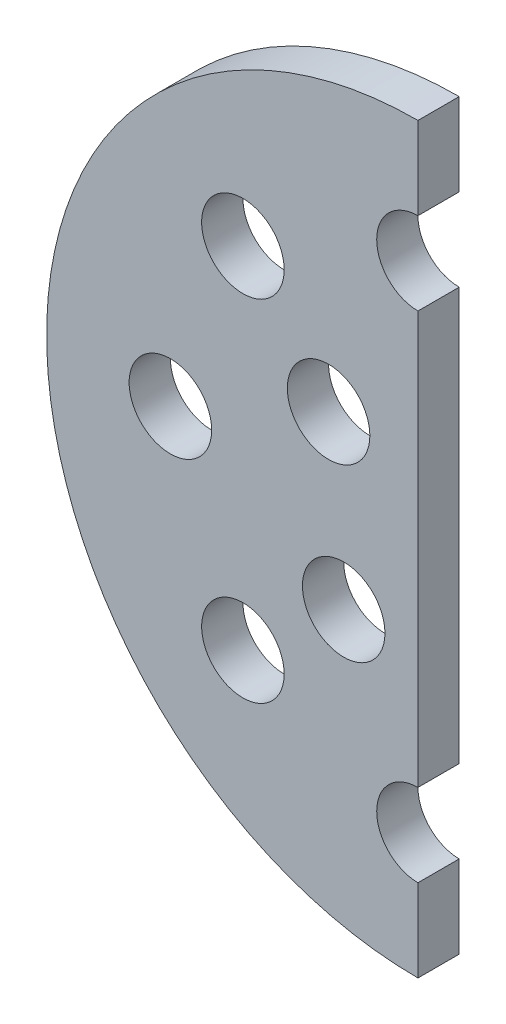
ISO-10303-21;
HEADER;
FILE_DESCRIPTION(('STEP AP214'),'2;1');
FILE_NAME('part.step','',(''),(''),'','','');
FILE_SCHEMA(('AUTOMOTIVE_DESIGN { 1 0 10303 214 1 1 1 1 }'));
ENDSEC;
DATA;
#1=APPLICATION_CONTEXT('core data for automotive mechanical design processes');
#2=APPLICATION_PROTOCOL_DEFINITION('international standard','automotive_design',2000,#1);
#3=PRODUCT_CONTEXT('',#1,'mechanical');
#4=PRODUCT('Part','Part','',(#3));
#5=PRODUCT_RELATED_PRODUCT_CATEGORY('part','',(#4));
#6=PRODUCT_DEFINITION_FORMATION('','',#4);
#7=PRODUCT_DEFINITION_CONTEXT('part definition',#1,'design');
#8=PRODUCT_DEFINITION('design','',#6,#7);
#9=PRODUCT_DEFINITION_SHAPE('','',#8);
#10=(LENGTH_UNIT() NAMED_UNIT(*) SI_UNIT(.MILLI.,.METRE.));
#11=(NAMED_UNIT(*) PLANE_ANGLE_UNIT() SI_UNIT($,.RADIAN.));
#12=(NAMED_UNIT(*) SI_UNIT($,.STERADIAN.) SOLID_ANGLE_UNIT());
#13=UNCERTAINTY_MEASURE_WITH_UNIT(LENGTH_MEASURE(1.E-05),#10,'distance_accuracy_value','');
#14=(GEOMETRIC_REPRESENTATION_CONTEXT(3) GLOBAL_UNCERTAINTY_ASSIGNED_CONTEXT((#13)) GLOBAL_UNIT_ASSIGNED_CONTEXT((#10,
#11,#12)) REPRESENTATION_CONTEXT('',''));
#15=CARTESIAN_POINT('',(0.,0.,0.));
#16=DIRECTION('',(0.,0.,1.));
#17=DIRECTION('',(1.,0.,0.));
#18=AXIS2_PLACEMENT_3D('',#15,#16,#17);
#19=CARTESIAN_POINT('',(0.,0.,25.));
#20=DIRECTION('',(0.,0.,1.));
#21=DIRECTION('',(1.,0.,0.));
#22=AXIS2_PLACEMENT_3D('',#19,#20,#21);
#23=PLANE('',#22);
#24=CARTESIAN_POINT('',(-106.06601717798,106.066017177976,25.));
#25=DIRECTION('',(0.,0.,1.));
#26=DIRECTION('',(1.,0.,0.));
#27=AXIS2_PLACEMENT_3D('',#24,#25,#26);
#28=CIRCLE('',#27,25.0000000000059);
#29=CARTESIAN_POINT('',(-81.0660171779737,106.066017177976,25.));
#30=VERTEX_POINT('',#29);
#31=EDGE_CURVE('E120',#30,#30,#28,.T.);
#32=ORIENTED_EDGE('',*,*,#31,.F.);
#33=EDGE_LOOP('',(#32));
#34=FACE_BOUND('',#33,.T.);
#35=CARTESIAN_POINT('',(-106.066017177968,-106.066017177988,25.));
#36=DIRECTION('',(0.,0.,1.));
#37=DIRECTION('',(1.,0.,0.));
#38=AXIS2_PLACEMENT_3D('',#35,#36,#37);
#39=CIRCLE('',#38,25.0000000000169);
#40=CARTESIAN_POINT('',(-81.0660171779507,-106.066017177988,25.));
#41=VERTEX_POINT('',#40);
#42=EDGE_CURVE('E132',#41,#41,#39,.T.);
#43=ORIENTED_EDGE('',*,*,#42,.F.);
#44=EDGE_LOOP('',(#43));
#45=FACE_BOUND('',#44,.T.);
#46=CARTESIAN_POINT('',(-54.1510019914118,45.,25.));
#47=DIRECTION('',(0.,0.,1.));
#48=DIRECTION('',(1.,0.,0.));
#49=AXIS2_PLACEMENT_3D('',#46,#47,#48);
#50=CIRCLE('',#49,25.);
#51=CARTESIAN_POINT('',(-29.1510019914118,45.,25.));
#52=VERTEX_POINT('',#51);
#53=EDGE_CURVE('E142',#52,#52,#50,.T.);
#54=ORIENTED_EDGE('',*,*,#53,.F.);
#55=EDGE_LOOP('',(#54));
#56=FACE_BOUND('',#55,.T.);
#57=CARTESIAN_POINT('',(-149.999999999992,-8.52651282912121E-12,25.));
#58=DIRECTION('',(0.,0.,1.));
#59=DIRECTION('',(1.,0.,0.));
#60=AXIS2_PLACEMENT_3D('',#57,#58,#59);
#61=CIRCLE('',#60,25.0000000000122);
#62=CARTESIAN_POINT('',(-124.999999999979,-8.52651282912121E-12,25.));
#63=VERTEX_POINT('',#62);
#64=EDGE_CURVE('E126',#63,#63,#61,.T.);
#65=ORIENTED_EDGE('',*,*,#64,.F.);
#66=EDGE_LOOP('',(#65));
#67=FACE_BOUND('',#66,.T.);
#68=CARTESIAN_POINT('',(-45.0000000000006,-54.1510019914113,25.));
#69=DIRECTION('',(0.,0.,1.));
#70=DIRECTION('',(1.,0.,0.));
#71=AXIS2_PLACEMENT_3D('',#68,#69,#70);
#72=CIRCLE('',#71,25.);
#73=CARTESIAN_POINT('',(-20.0000000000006,-54.1510019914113,25.));
#74=VERTEX_POINT('',#73);
#75=EDGE_CURVE('E114',#74,#74,#72,.T.);
#76=ORIENTED_EDGE('',*,*,#75,.F.);
#77=EDGE_LOOP('',(#76));
#78=FACE_BOUND('',#77,.T.);
#79=CARTESIAN_POINT('',(0.,0.,25.));
#80=DIRECTION('',(0.,0.,1.));
#81=DIRECTION('',(1.,0.,0.));
#82=AXIS2_PLACEMENT_3D('',#79,#80,#81);
#83=CIRCLE('',#82,225.);
#84=CARTESIAN_POINT('',(0.,-225.,25.));
#85=VERTEX_POINT('',#84);
#86=CARTESIAN_POINT('',(0.,225.,25.));
#87=VERTEX_POINT('',#86);
#88=EDGE_CURVE('E103',#85,#87,#83,.F.);
#89=ORIENTED_EDGE('',*,*,#88,.F.);
#90=DIRECTION('',(0.,1.,0.));
#91=VECTOR('',#90,1.);
#92=CARTESIAN_POINT('',(0.,0.,25.));
#93=LINE('',#92,#91);
#94=CARTESIAN_POINT('',(0.,-175.000000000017,25.));
#95=VERTEX_POINT('',#94);
#96=EDGE_CURVE('E88',#85,#95,#93,.T.);
#97=ORIENTED_EDGE('',*,*,#96,.T.);
#98=CARTESIAN_POINT('',(1.7016286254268E-11,-150.,25.));
#99=DIRECTION('',(0.,0.,1.));
#100=DIRECTION('',(1.,0.,0.));
#101=AXIS2_PLACEMENT_3D('',#98,#99,#100);
#102=CIRCLE('',#101,25.0000000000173);
#103=CARTESIAN_POINT('',(0.,-124.999999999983,25.));
#104=VERTEX_POINT('',#103);
#105=EDGE_CURVE('E137',#104,#95,#102,.T.);
#106=ORIENTED_EDGE('',*,*,#105,.F.);
#107=CARTESIAN_POINT('',(0.,125.,25.));
#108=VERTEX_POINT('',#107);
#109=EDGE_CURVE('E47',#104,#108,#93,.T.);
#110=ORIENTED_EDGE('',*,*,#109,.T.);
#111=CARTESIAN_POINT('',(0.,150.,25.));
#112=DIRECTION('',(0.,0.,1.));
#113=DIRECTION('',(1.,0.,0.));
#114=AXIS2_PLACEMENT_3D('',#111,#112,#113);
#115=CIRCLE('',#114,25.);
#116=CARTESIAN_POINT('',(0.,175.,25.));
#117=VERTEX_POINT('',#116);
#118=EDGE_CURVE('E148',#117,#108,#115,.T.);
#119=ORIENTED_EDGE('',*,*,#118,.F.);
#120=EDGE_CURVE('E104',#117,#87,#93,.T.);
#121=ORIENTED_EDGE('',*,*,#120,.T.);
#122=EDGE_LOOP('',(#89,#97,#106,#110,#119,#121));
#123=FACE_BOUND('',#122,.T.);
#124=ADVANCED_FACE('F32',(#34,#45,#56,#67,#78,#123),#23,.T.);
#125=CARTESIAN_POINT('',(0.,0.,0.));
#126=DIRECTION('',(0.,0.,1.));
#127=DIRECTION('',(1.,0.,0.));
#128=AXIS2_PLACEMENT_3D('',#125,#126,#127);
#129=PLANE('',#128);
#130=CARTESIAN_POINT('',(-54.1510019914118,45.,0.));
#131=DIRECTION('',(0.,0.,1.));
#132=DIRECTION('',(1.,0.,0.));
#133=AXIS2_PLACEMENT_3D('',#130,#131,#132);
#134=CIRCLE('',#133,25.);
#135=CARTESIAN_POINT('',(-29.1510019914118,45.,0.));
#136=VERTEX_POINT('',#135);
#137=EDGE_CURVE('E140',#136,#136,#134,.T.);
#138=ORIENTED_EDGE('',*,*,#137,.T.);
#139=EDGE_LOOP('',(#138));
#140=FACE_BOUND('',#139,.T.);
#141=CARTESIAN_POINT('',(-106.066017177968,-106.066017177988,0.));
#142=DIRECTION('',(0.,0.,1.));
#143=DIRECTION('',(1.,0.,0.));
#144=AXIS2_PLACEMENT_3D('',#141,#142,#143);
#145=CIRCLE('',#144,25.0000000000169);
#146=CARTESIAN_POINT('',(-81.0660171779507,-106.066017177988,0.));
#147=VERTEX_POINT('',#146);
#148=EDGE_CURVE('E129',#147,#147,#145,.T.);
#149=ORIENTED_EDGE('',*,*,#148,.T.);
#150=EDGE_LOOP('',(#149));
#151=FACE_BOUND('',#150,.T.);
#152=CARTESIAN_POINT('',(-149.999999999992,-8.52651282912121E-12,0.));
#153=DIRECTION('',(0.,0.,1.));
#154=DIRECTION('',(1.,0.,0.));
#155=AXIS2_PLACEMENT_3D('',#152,#153,#154);
#156=CIRCLE('',#155,25.0000000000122);
#157=CARTESIAN_POINT('',(-124.999999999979,-8.52651282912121E-12,0.));
#158=VERTEX_POINT('',#157);
#159=EDGE_CURVE('E123',#158,#158,#156,.T.);
#160=ORIENTED_EDGE('',*,*,#159,.T.);
#161=EDGE_LOOP('',(#160));
#162=FACE_BOUND('',#161,.T.);
#163=CARTESIAN_POINT('',(-106.06601717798,106.066017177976,0.));
#164=DIRECTION('',(0.,0.,1.));
#165=DIRECTION('',(1.,0.,0.));
#166=AXIS2_PLACEMENT_3D('',#163,#164,#165);
#167=CIRCLE('',#166,25.0000000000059);
#168=CARTESIAN_POINT('',(-81.0660171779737,106.066017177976,0.));
#169=VERTEX_POINT('',#168);
#170=EDGE_CURVE('E117',#169,#169,#167,.T.);
#171=ORIENTED_EDGE('',*,*,#170,.T.);
#172=EDGE_LOOP('',(#171));
#173=FACE_BOUND('',#172,.T.);
#174=CARTESIAN_POINT('',(-45.0000000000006,-54.1510019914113,0.));
#175=DIRECTION('',(0.,0.,1.));
#176=DIRECTION('',(1.,0.,0.));
#177=AXIS2_PLACEMENT_3D('',#174,#175,#176);
#178=CIRCLE('',#177,25.);
#179=CARTESIAN_POINT('',(-20.0000000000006,-54.1510019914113,0.));
#180=VERTEX_POINT('',#179);
#181=EDGE_CURVE('E106',#180,#180,#178,.T.);
#182=ORIENTED_EDGE('',*,*,#181,.T.);
#183=EDGE_LOOP('',(#182));
#184=FACE_BOUND('',#183,.T.);
#185=DIRECTION('',(0.,-1.,0.));
#186=VECTOR('',#185,1.);
#187=CARTESIAN_POINT('',(0.,225.,0.));
#188=LINE('',#187,#186);
#189=CARTESIAN_POINT('',(0.,-175.000000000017,0.));
#190=VERTEX_POINT('',#189);
#191=CARTESIAN_POINT('',(0.,-225.,0.));
#192=VERTEX_POINT('',#191);
#193=EDGE_CURVE('E85',#190,#192,#188,.T.);
#194=ORIENTED_EDGE('',*,*,#193,.T.);
#195=CARTESIAN_POINT('',(0.,0.,0.));
#196=DIRECTION('',(0.,0.,1.));
#197=DIRECTION('',(1.,0.,0.));
#198=AXIS2_PLACEMENT_3D('',#195,#196,#197);
#199=CIRCLE('',#198,225.);
#200=CARTESIAN_POINT('',(0.,225.,0.));
#201=VERTEX_POINT('',#200);
#202=EDGE_CURVE('E96',#201,#192,#199,.T.);
#203=ORIENTED_EDGE('',*,*,#202,.F.);
#204=CARTESIAN_POINT('',(0.,175.,0.));
#205=VERTEX_POINT('',#204);
#206=EDGE_CURVE('E55',#201,#205,#188,.T.);
#207=ORIENTED_EDGE('',*,*,#206,.T.);
#208=CARTESIAN_POINT('',(0.,150.,0.));
#209=DIRECTION('',(0.,0.,1.));
#210=DIRECTION('',(1.,0.,0.));
#211=AXIS2_PLACEMENT_3D('',#208,#209,#210);
#212=CIRCLE('',#211,25.);
#213=CARTESIAN_POINT('',(0.,125.,0.));
#214=VERTEX_POINT('',#213);
#215=EDGE_CURVE('E145',#205,#214,#212,.T.);
#216=ORIENTED_EDGE('',*,*,#215,.T.);
#217=CARTESIAN_POINT('',(0.,-124.999999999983,0.));
#218=VERTEX_POINT('',#217);
#219=EDGE_CURVE('E100',#214,#218,#188,.T.);
#220=ORIENTED_EDGE('',*,*,#219,.T.);
#221=CARTESIAN_POINT('',(1.7016286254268E-11,-150.,0.));
#222=DIRECTION('',(0.,0.,1.));
#223=DIRECTION('',(1.,0.,0.));
#224=AXIS2_PLACEMENT_3D('',#221,#222,#223);
#225=CIRCLE('',#224,25.0000000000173);
#226=EDGE_CURVE('E99',#218,#190,#225,.T.);
#227=ORIENTED_EDGE('',*,*,#226,.T.);
#228=EDGE_LOOP('',(#194,#203,#207,#216,#220,#227));
#229=FACE_BOUND('',#228,.T.);
#230=ADVANCED_FACE('F34',(#140,#151,#162,#173,#184,#229),#129,.F.);
#231=CARTESIAN_POINT('',(0.,150.,25.));
#232=DIRECTION('',(0.,0.,-1.));
#233=DIRECTION('',(-1.,0.,0.));
#234=AXIS2_PLACEMENT_3D('',#231,#232,#233);
#235=CYLINDRICAL_SURFACE('',#234,25.);
#236=ORIENTED_EDGE('',*,*,#118,.T.);
#237=DIRECTION('',(0.,0.,-1.));
#238=VECTOR('',#237,1.);
#239=CARTESIAN_POINT('',(0.,125.,25.));
#240=LINE('',#239,#238);
#241=EDGE_CURVE('E161',#108,#214,#240,.T.);
#242=ORIENTED_EDGE('',*,*,#241,.T.);
#243=ORIENTED_EDGE('',*,*,#215,.F.);
#244=DIRECTION('',(0.,0.,-1.));
#245=VECTOR('',#244,1.);
#246=CARTESIAN_POINT('',(0.,175.,25.));
#247=LINE('',#246,#245);
#248=EDGE_CURVE('E109',#205,#117,#247,.F.);
#249=ORIENTED_EDGE('',*,*,#248,.T.);
#250=EDGE_LOOP('',(#236,#242,#243,#249));
#251=FACE_BOUND('',#250,.T.);
#252=ADVANCED_FACE('F159',(#251),#235,.F.);
#253=CARTESIAN_POINT('',(1.7016286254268E-11,-150.,25.));
#254=DIRECTION('',(0.,0.,-1.));
#255=DIRECTION('',(-1.,0.,0.));
#256=AXIS2_PLACEMENT_3D('',#253,#254,#255);
#257=CYLINDRICAL_SURFACE('',#256,25.0000000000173);
#258=ORIENTED_EDGE('',*,*,#105,.T.);
#259=DIRECTION('',(0.,0.,-1.));
#260=VECTOR('',#259,1.);
#261=CARTESIAN_POINT('',(0.,-175.000000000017,25.));
#262=LINE('',#261,#260);
#263=EDGE_CURVE('E162',#95,#190,#262,.T.);
#264=ORIENTED_EDGE('',*,*,#263,.T.);
#265=ORIENTED_EDGE('',*,*,#226,.F.);
#266=DIRECTION('',(0.,0.,-1.));
#267=VECTOR('',#266,1.);
#268=CARTESIAN_POINT('',(0.,-124.999999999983,25.));
#269=LINE('',#268,#267);
#270=EDGE_CURVE('E165',#218,#104,#269,.F.);
#271=ORIENTED_EDGE('',*,*,#270,.T.);
#272=EDGE_LOOP('',(#258,#264,#265,#271));
#273=FACE_BOUND('',#272,.T.);
#274=ADVANCED_FACE('F167',(#273),#257,.F.);
#275=CARTESIAN_POINT('',(0.,0.,100.));
#276=DIRECTION('',(0.,0.,-1.));
#277=DIRECTION('',(-1.,0.,0.));
#278=AXIS2_PLACEMENT_3D('',#275,#276,#277);
#279=CYLINDRICAL_SURFACE('',#278,225.);
#280=DIRECTION('',(0.,0.,-1.));
#281=VECTOR('',#280,1.);
#282=CARTESIAN_POINT('',(0.,-225.,100.));
#283=LINE('',#282,#281);
#284=EDGE_CURVE('E11',#85,#192,#283,.T.);
#285=ORIENTED_EDGE('',*,*,#284,.F.);
#286=ORIENTED_EDGE('',*,*,#88,.T.);
#287=DIRECTION('',(0.,0.,-1.));
#288=VECTOR('',#287,1.);
#289=CARTESIAN_POINT('',(0.,225.,100.));
#290=LINE('',#289,#288);
#291=EDGE_CURVE('E40',#201,#87,#290,.F.);
#292=ORIENTED_EDGE('',*,*,#291,.F.);
#293=ORIENTED_EDGE('',*,*,#202,.T.);
#294=EDGE_LOOP('',(#285,#286,#292,#293));
#295=FACE_BOUND('',#294,.T.);
#296=ADVANCED_FACE('F102',(#295),#279,.T.);
#297=CARTESIAN_POINT('',(-54.1510019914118,45.,25.));
#298=DIRECTION('',(0.,0.,-1.));
#299=DIRECTION('',(-1.,0.,0.));
#300=AXIS2_PLACEMENT_3D('',#297,#298,#299);
#301=CYLINDRICAL_SURFACE('',#300,25.);
#302=ORIENTED_EDGE('',*,*,#53,.T.);
#303=EDGE_LOOP('',(#302));
#304=FACE_BOUND('',#303,.T.);
#305=ORIENTED_EDGE('',*,*,#137,.F.);
#306=EDGE_LOOP('',(#305));
#307=FACE_BOUND('',#306,.T.);
#308=ADVANCED_FACE('F174',(#304,#307),#301,.F.);
#309=CARTESIAN_POINT('',(-106.066017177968,-106.066017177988,25.));
#310=DIRECTION('',(0.,0.,-1.));
#311=DIRECTION('',(-1.,0.,0.));
#312=AXIS2_PLACEMENT_3D('',#309,#310,#311);
#313=CYLINDRICAL_SURFACE('',#312,25.0000000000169);
#314=ORIENTED_EDGE('',*,*,#42,.T.);
#315=EDGE_LOOP('',(#314));
#316=FACE_BOUND('',#315,.T.);
#317=ORIENTED_EDGE('',*,*,#148,.F.);
#318=EDGE_LOOP('',(#317));
#319=FACE_BOUND('',#318,.T.);
#320=ADVANCED_FACE('F188',(#316,#319),#313,.F.);
#321=CARTESIAN_POINT('',(-149.999999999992,-8.52651282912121E-12,25.));
#322=DIRECTION('',(0.,0.,-1.));
#323=DIRECTION('',(-1.,0.,0.));
#324=AXIS2_PLACEMENT_3D('',#321,#322,#323);
#325=CYLINDRICAL_SURFACE('',#324,25.0000000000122);
#326=ORIENTED_EDGE('',*,*,#64,.T.);
#327=EDGE_LOOP('',(#326));
#328=FACE_BOUND('',#327,.T.);
#329=ORIENTED_EDGE('',*,*,#159,.F.);
#330=EDGE_LOOP('',(#329));
#331=FACE_BOUND('',#330,.T.);
#332=ADVANCED_FACE('F193',(#328,#331),#325,.F.);
#333=CARTESIAN_POINT('',(-106.06601717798,106.066017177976,25.));
#334=DIRECTION('',(0.,0.,-1.));
#335=DIRECTION('',(-1.,0.,0.));
#336=AXIS2_PLACEMENT_3D('',#333,#334,#335);
#337=CYLINDRICAL_SURFACE('',#336,25.0000000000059);
#338=ORIENTED_EDGE('',*,*,#31,.T.);
#339=EDGE_LOOP('',(#338));
#340=FACE_BOUND('',#339,.T.);
#341=ORIENTED_EDGE('',*,*,#170,.F.);
#342=EDGE_LOOP('',(#341));
#343=FACE_BOUND('',#342,.T.);
#344=ADVANCED_FACE('F209',(#340,#343),#337,.F.);
#345=CARTESIAN_POINT('',(-45.0000000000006,-54.1510019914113,25.));
#346=DIRECTION('',(0.,0.,-1.));
#347=DIRECTION('',(-1.,0.,0.));
#348=AXIS2_PLACEMENT_3D('',#345,#346,#347);
#349=CYLINDRICAL_SURFACE('',#348,25.);
#350=ORIENTED_EDGE('',*,*,#75,.T.);
#351=EDGE_LOOP('',(#350));
#352=FACE_BOUND('',#351,.T.);
#353=ORIENTED_EDGE('',*,*,#181,.F.);
#354=EDGE_LOOP('',(#353));
#355=FACE_BOUND('',#354,.T.);
#356=ADVANCED_FACE('F207',(#352,#355),#349,.F.);
#357=CARTESIAN_POINT('',(0.,225.,100.));
#358=DIRECTION('',(1.,0.,0.));
#359=DIRECTION('',(0.,0.,-1.));
#360=AXIS2_PLACEMENT_3D('',#357,#358,#359);
#361=PLANE('',#360);
#362=ORIENTED_EDGE('',*,*,#248,.F.);
#363=ORIENTED_EDGE('',*,*,#206,.F.);
#364=ORIENTED_EDGE('',*,*,#291,.T.);
#365=ORIENTED_EDGE('',*,*,#120,.F.);
#366=EDGE_LOOP('',(#362,#363,#364,#365));
#367=FACE_BOUND('',#366,.T.);
#368=ADVANCED_FACE('F152',(#367),#361,.T.);
#369=ORIENTED_EDGE('',*,*,#284,.T.);
#370=ORIENTED_EDGE('',*,*,#193,.F.);
#371=ORIENTED_EDGE('',*,*,#263,.F.);
#372=ORIENTED_EDGE('',*,*,#96,.F.);
#373=EDGE_LOOP('',(#369,#370,#371,#372));
#374=FACE_BOUND('',#373,.T.);
#375=ADVANCED_FACE('F84',(#374),#361,.T.);
#376=ORIENTED_EDGE('',*,*,#109,.F.);
#377=ORIENTED_EDGE('',*,*,#270,.F.);
#378=ORIENTED_EDGE('',*,*,#219,.F.);
#379=ORIENTED_EDGE('',*,*,#241,.F.);
#380=EDGE_LOOP('',(#376,#377,#378,#379));
#381=FACE_BOUND('',#380,.T.);
#382=ADVANCED_FACE('F217',(#381),#361,.T.);
#383=CLOSED_SHELL('',(#124,#230,#252,#274,#296,#308,#320,#332,#344,#356,#368,#375,#382));
#384=MANIFOLD_SOLID_BREP('B2',#383);
#385=ADVANCED_BREP_SHAPE_REPRESENTATION('',(#18,#384),#14);
#386=SHAPE_DEFINITION_REPRESENTATION(#9,#385);
ENDSEC;
END-ISO-10303-21;
